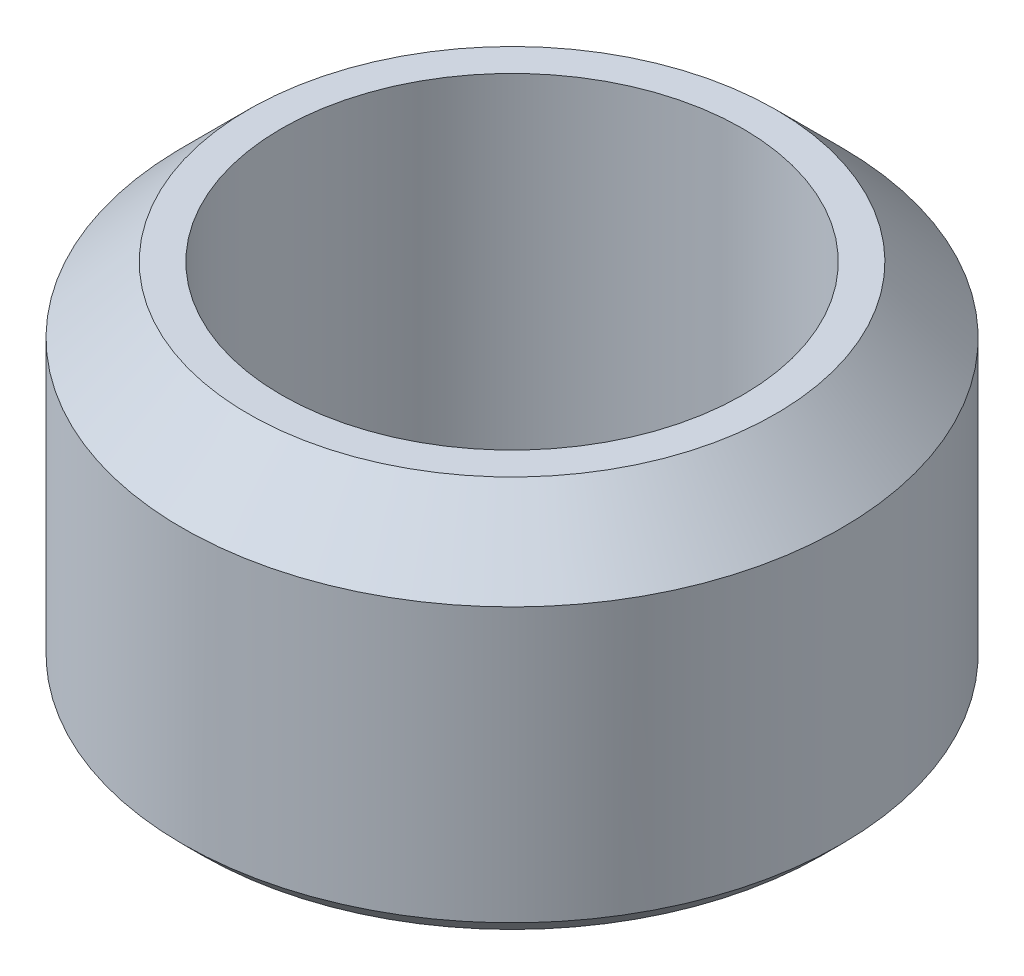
ISO-10303-21;
HEADER;
FILE_DESCRIPTION(('STEP AP214'),'2;1');
FILE_NAME('part.step','',(''),(''),'','','');
FILE_SCHEMA(('AUTOMOTIVE_DESIGN { 1 0 10303 214 1 1 1 1 }'));
ENDSEC;
DATA;
#1=APPLICATION_CONTEXT('core data for automotive mechanical design processes');
#2=APPLICATION_PROTOCOL_DEFINITION('international standard','automotive_design',2000,#1);
#3=PRODUCT_CONTEXT('',#1,'mechanical');
#4=PRODUCT('Part','Part','',(#3));
#5=PRODUCT_RELATED_PRODUCT_CATEGORY('part','',(#4));
#6=PRODUCT_DEFINITION_FORMATION('','',#4);
#7=PRODUCT_DEFINITION_CONTEXT('part definition',#1,'design');
#8=PRODUCT_DEFINITION('design','',#6,#7);
#9=PRODUCT_DEFINITION_SHAPE('','',#8);
#10=(LENGTH_UNIT() NAMED_UNIT(*) SI_UNIT(.MILLI.,.METRE.));
#11=(NAMED_UNIT(*) PLANE_ANGLE_UNIT() SI_UNIT($,.RADIAN.));
#12=(NAMED_UNIT(*) SI_UNIT($,.STERADIAN.) SOLID_ANGLE_UNIT());
#13=UNCERTAINTY_MEASURE_WITH_UNIT(LENGTH_MEASURE(1.E-05),#10,'distance_accuracy_value','');
#14=(GEOMETRIC_REPRESENTATION_CONTEXT(3) GLOBAL_UNCERTAINTY_ASSIGNED_CONTEXT((#13)) GLOBAL_UNIT_ASSIGNED_CONTEXT((#10,
#11,#12)) REPRESENTATION_CONTEXT('',''));
#15=CARTESIAN_POINT('',(0.,0.,0.));
#16=DIRECTION('',(0.,0.,1.));
#17=DIRECTION('',(1.,0.,0.));
#18=AXIS2_PLACEMENT_3D('',#15,#16,#17);
#19=CARTESIAN_POINT('',(-2.22044604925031E-13,54.4999999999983,-4.44089209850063E-13));
#20=DIRECTION('',(0.,-0.999999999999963,0.));
#21=DIRECTION('',(0.,0.,-0.999999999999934));
#22=AXIS2_PLACEMENT_3D('',#19,#20,#21);
#23=CYLINDRICAL_SURFACE('',#22,50.);
#24=CARTESIAN_POINT('',(0.,3.,-3.33066907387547E-13));
#25=DIRECTION('',(0.,0.999999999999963,0.));
#26=DIRECTION('',(0.,0.,0.999999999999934));
#27=AXIS2_PLACEMENT_3D('',#24,#25,#26);
#28=CIRCLE('',#27,50.);
#29=CARTESIAN_POINT('',(9.9711362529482E-13,3.,-49.9999999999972));
#30=VERTEX_POINT('',#29);
#31=EDGE_CURVE('E38',#30,#30,#28,.T.);
#32=CARTESIAN_POINT('',(0.,44.4999999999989,0.));
#33=DIRECTION('',(0.,0.999999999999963,0.));
#34=DIRECTION('',(0.,0.,0.999999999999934));
#35=AXIS2_PLACEMENT_3D('',#32,#33,#34);
#36=CIRCLE('',#35,50.);
#37=CARTESIAN_POINT('',(1.77042740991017E-12,44.4999999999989,-49.9999999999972));
#38=VERTEX_POINT('',#37);
#39=EDGE_CURVE('E42',#38,#38,#36,.F.);
#40=CARTESIAN_POINT('',(9.9711362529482E-13,3.,-49.9999999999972));
#41=CARTESIAN_POINT('',(1.0051689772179E-12,3.43229166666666,-49.9999999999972));
#42=CARTESIAN_POINT('',(1.01322432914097E-12,3.86458333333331,-49.9999999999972));
#43=CARTESIAN_POINT('',(1.02933503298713E-12,4.72916666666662,-49.9999999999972));
#44=CARTESIAN_POINT('',(1.0373903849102E-12,5.16145833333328,-49.9999999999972));
#45=CARTESIAN_POINT('',(1.05350108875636E-12,6.02604166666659,-49.9999999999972));
#46=CARTESIAN_POINT('',(1.06155644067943E-12,6.45833333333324,-49.9999999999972));
#47=CARTESIAN_POINT('',(1.07766714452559E-12,7.32291666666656,-49.9999999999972));
#48=CARTESIAN_POINT('',(1.08572249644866E-12,7.75520833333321,-49.9999999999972));
#49=CARTESIAN_POINT('',(1.10183320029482E-12,8.61979166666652,-49.9999999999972));
#50=CARTESIAN_POINT('',(1.10988855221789E-12,9.05208333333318,-49.9999999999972));
#51=CARTESIAN_POINT('',(1.12599925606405E-12,9.91666666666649,-49.9999999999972));
#52=CARTESIAN_POINT('',(1.13405460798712E-12,10.3489583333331,-49.9999999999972));
#53=CARTESIAN_POINT('',(1.15016531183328E-12,11.2135416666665,-49.9999999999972));
#54=CARTESIAN_POINT('',(1.15822066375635E-12,11.6458333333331,-49.9999999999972));
#55=CARTESIAN_POINT('',(1.1743313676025E-12,12.5104166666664,-49.9999999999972));
#56=CARTESIAN_POINT('',(1.18238671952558E-12,12.9427083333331,-49.9999999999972));
#57=CARTESIAN_POINT('',(1.19849742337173E-12,13.8072916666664,-49.9999999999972));
#58=CARTESIAN_POINT('',(1.20655277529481E-12,14.239583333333,-49.9999999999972));
#59=CARTESIAN_POINT('',(1.22266347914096E-12,15.1041666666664,-49.9999999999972));
#60=CARTESIAN_POINT('',(1.23071883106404E-12,15.536458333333,-49.9999999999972));
#61=CARTESIAN_POINT('',(1.24682953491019E-12,16.4010416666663,-49.9999999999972));
#62=CARTESIAN_POINT('',(1.25488488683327E-12,16.833333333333,-49.9999999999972));
#63=CARTESIAN_POINT('',(1.27099559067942E-12,17.6979166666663,-49.9999999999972));
#64=CARTESIAN_POINT('',(1.2790509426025E-12,18.1302083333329,-49.9999999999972));
#65=CARTESIAN_POINT('',(1.29516164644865E-12,18.9947916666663,-49.9999999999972));
#66=CARTESIAN_POINT('',(1.30321699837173E-12,19.4270833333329,-49.9999999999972));
#67=CARTESIAN_POINT('',(1.31932770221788E-12,20.2916666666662,-49.9999999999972));
#68=CARTESIAN_POINT('',(1.32738305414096E-12,20.7239583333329,-49.9999999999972));
#69=CARTESIAN_POINT('',(1.34349375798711E-12,21.5885416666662,-49.9999999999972));
#70=CARTESIAN_POINT('',(1.35154910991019E-12,22.0208333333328,-49.9999999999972));
#71=CARTESIAN_POINT('',(1.36765981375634E-12,22.8854166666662,-49.9999999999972));
#72=CARTESIAN_POINT('',(1.37571516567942E-12,23.3177083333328,-49.9999999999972));
#73=CARTESIAN_POINT('',(1.39182586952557E-12,24.1822916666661,-49.9999999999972));
#74=CARTESIAN_POINT('',(1.39988122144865E-12,24.6145833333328,-49.9999999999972));
#75=CARTESIAN_POINT('',(1.4159919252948E-12,25.4791666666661,-49.9999999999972));
#76=CARTESIAN_POINT('',(1.42404727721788E-12,25.9114583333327,-49.9999999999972));
#77=CARTESIAN_POINT('',(1.44015798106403E-12,26.7760416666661,-49.9999999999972));
#78=CARTESIAN_POINT('',(1.44821333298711E-12,27.2083333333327,-49.9999999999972));
#79=CARTESIAN_POINT('',(1.46432403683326E-12,28.072916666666,-49.9999999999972));
#80=CARTESIAN_POINT('',(1.47237938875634E-12,28.5052083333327,-49.9999999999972));
#81=CARTESIAN_POINT('',(1.48849009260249E-12,29.369791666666,-49.9999999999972));
#82=CARTESIAN_POINT('',(1.49654544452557E-12,29.8020833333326,-49.9999999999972));
#83=CARTESIAN_POINT('',(1.51265614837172E-12,30.666666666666,-49.9999999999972));
#84=CARTESIAN_POINT('',(1.5207115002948E-12,31.0989583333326,-49.9999999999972));
#85=CARTESIAN_POINT('',(1.53682220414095E-12,31.9635416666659,-49.9999999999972));
#86=CARTESIAN_POINT('',(1.54487755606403E-12,32.3958333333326,-49.9999999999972));
#87=CARTESIAN_POINT('',(1.56098825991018E-12,33.2604166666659,-49.9999999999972));
#88=CARTESIAN_POINT('',(1.56904361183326E-12,33.6927083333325,-49.9999999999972));
#89=CARTESIAN_POINT('',(1.58515431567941E-12,34.5572916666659,-49.9999999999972));
#90=CARTESIAN_POINT('',(1.59320966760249E-12,34.9895833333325,-49.9999999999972));
#91=CARTESIAN_POINT('',(1.60932037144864E-12,35.8541666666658,-49.9999999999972));
#92=CARTESIAN_POINT('',(1.61737572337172E-12,36.2864583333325,-49.9999999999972));
#93=CARTESIAN_POINT('',(1.63348642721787E-12,37.1510416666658,-49.9999999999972));
#94=CARTESIAN_POINT('',(1.64154177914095E-12,37.5833333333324,-49.9999999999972));
#95=CARTESIAN_POINT('',(1.6576524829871E-12,38.4479166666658,-49.9999999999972));
#96=CARTESIAN_POINT('',(1.66570783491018E-12,38.8802083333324,-49.9999999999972));
#97=CARTESIAN_POINT('',(1.68181853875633E-12,39.7447916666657,-49.9999999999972));
#98=CARTESIAN_POINT('',(1.68987389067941E-12,40.1770833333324,-49.9999999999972));
#99=CARTESIAN_POINT('',(1.70598459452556E-12,41.0416666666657,-49.9999999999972));
#100=CARTESIAN_POINT('',(1.71403994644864E-12,41.4739583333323,-49.9999999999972));
#101=CARTESIAN_POINT('',(1.73015065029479E-12,42.3385416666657,-49.9999999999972));
#102=CARTESIAN_POINT('',(1.73820600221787E-12,42.7708333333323,-49.9999999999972));
#103=CARTESIAN_POINT('',(1.75431670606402E-12,43.6354166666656,-49.9999999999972));
#104=CARTESIAN_POINT('',(1.7623720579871E-12,44.0677083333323,-49.9999999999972));
#105=CARTESIAN_POINT('',(1.77042740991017E-12,44.4999999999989,-49.9999999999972));
#106=B_SPLINE_CURVE_WITH_KNOTS('',3,(#40,#41,#42,#43,#44,#45,#46,#47,#48,#49,#50,#51,#52,#53,
#54,#55,#56,#57,#58,#59,#60,#61,#62,#63,#64,#65,#66,#67,#68,#69,#70,#71,#72,#73,#74,#75,#76,#77,
#78,#79,#80,#81,#82,#83,#84,#85,#86,#87,#88,#89,#90,#91,#92,#93,#94,#95,#96,#97,#98,#99,#100,
#101,#102,#103,#104,#105),.UNSPECIFIED.,.F.,.F.,(4,2,2,2,2,2,2,2,2,2,2,2,2,2,2,2,2,2,2,2,2,2,2,
2,2,2,2,2,2,2,2,2,4),(0.,1.29687499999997,2.59374999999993,3.8906249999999,5.18749999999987,
6.48437499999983,7.7812499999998,9.07812499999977,10.3749999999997,11.6718749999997,
12.9687499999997,14.2656249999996,15.5624999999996,16.8593749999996,18.1562499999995,
19.4531249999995,20.7499999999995,22.0468749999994,23.3437499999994,24.6406249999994,
25.9374999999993,27.2343749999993,28.5312499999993,29.8281249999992,31.1249999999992,
32.4218749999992,33.7187499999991,35.0156249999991,36.3124999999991,37.609374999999,
38.906249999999,40.203124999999,41.4999999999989),.UNSPECIFIED.);
#107=EDGE_CURVE('BSEAM32',#30,#38,#106,.T.);
#108=ORIENTED_EDGE('',*,*,#31,.T.);
#109=ORIENTED_EDGE('',*,*,#39,.T.);
#110=ORIENTED_EDGE('',*,*,#107,.T.);
#111=ORIENTED_EDGE('',*,*,#107,.F.);
#112=EDGE_LOOP('',(#108,#110,#109,#111));
#113=FACE_BOUND('',#112,.T.);
#114=ADVANCED_FACE('F32',(#113),#23,.T.);
#115=CARTESIAN_POINT('',(-2.22044604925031E-13,54.4999999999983,-4.44089209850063E-13));
#116=DIRECTION('',(0.,0.999999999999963,0.));
#117=DIRECTION('',(0.,0.,0.999999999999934));
#118=AXIS2_PLACEMENT_3D('',#115,#116,#117);
#119=PLANE('',#118);
#120=CARTESIAN_POINT('',(-2.22044604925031E-13,54.4999999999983,-4.44089209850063E-13));
#121=DIRECTION('',(0.,0.999999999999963,0.));
#122=DIRECTION('',(0.,0.,0.999999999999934));
#123=AXIS2_PLACEMENT_3D('',#120,#121,#122);
#124=CIRCLE('',#123,35.);
#125=CARTESIAN_POINT('',(-1.12021625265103E-12,54.4999999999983,34.9999999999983));
#126=VERTEX_POINT('',#125);
#127=EDGE_CURVE('E54',#126,#126,#124,.T.);
#128=ORIENTED_EDGE('',*,*,#127,.F.);
#129=EDGE_LOOP('',(#128));
#130=FACE_BOUND('',#129,.T.);
#131=CARTESIAN_POINT('',(-2.22044604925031E-13,54.4999999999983,-4.44089209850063E-13));
#132=DIRECTION('',(0.,0.999999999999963,0.));
#133=DIRECTION('',(0.,0.,0.999999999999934));
#134=AXIS2_PLACEMENT_3D('',#131,#132,#133);
#135=CIRCLE('',#134,40.);
#136=CARTESIAN_POINT('',(1.52100554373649E-12,54.4999999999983,-39.9999999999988));
#137=VERTEX_POINT('',#136);
#138=EDGE_CURVE('E46',#137,#137,#135,.T.);
#139=ORIENTED_EDGE('',*,*,#138,.T.);
#140=EDGE_LOOP('',(#139));
#141=FACE_BOUND('',#140,.T.);
#142=ADVANCED_FACE('F61',(#130,#141),#119,.T.);
#143=CARTESIAN_POINT('',(0.,0.,0.));
#144=DIRECTION('',(0.,0.999999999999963,0.));
#145=DIRECTION('',(0.,0.,0.999999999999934));
#146=AXIS2_PLACEMENT_3D('',#143,#144,#145);
#147=PLANE('',#146);
#148=CARTESIAN_POINT('',(0.,0.,0.));
#149=DIRECTION('',(0.,0.999999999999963,0.));
#150=DIRECTION('',(0.,0.,0.999999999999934));
#151=AXIS2_PLACEMENT_3D('',#148,#149,#150);
#152=CIRCLE('',#151,35.);
#153=CARTESIAN_POINT('',(-2.13577290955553E-12,0.,34.9999999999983));
#154=VERTEX_POINT('',#153);
#155=EDGE_CURVE('E51',#154,#154,#152,.F.);
#156=ORIENTED_EDGE('',*,*,#155,.F.);
#157=EDGE_LOOP('',(#156));
#158=FACE_BOUND('',#157,.T.);
#159=CARTESIAN_POINT('',(0.,0.,0.));
#160=DIRECTION('',(0.,0.999999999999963,0.));
#161=DIRECTION('',(0.,0.,0.999999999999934));
#162=AXIS2_PLACEMENT_3D('',#159,#160,#161);
#163=CIRCLE('',#162,47.);
#164=CARTESIAN_POINT('',(-2.04808392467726E-12,-1.12495407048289E-12,46.9999999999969));
#165=VERTEX_POINT('',#164);
#166=EDGE_CURVE('E10',#165,#165,#163,.F.);
#167=ORIENTED_EDGE('',*,*,#166,.T.);
#168=EDGE_LOOP('',(#167));
#169=FACE_BOUND('',#168,.T.);
#170=ADVANCED_FACE('F64',(#158,#169),#147,.F.);
#171=CARTESIAN_POINT('',(-2.22044604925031E-13,54.4999999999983,-4.44089209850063E-13));
#172=DIRECTION('',(0.,-0.999999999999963,0.));
#173=DIRECTION('',(0.,0.,-0.999999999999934));
#174=AXIS2_PLACEMENT_3D('',#171,#172,#173);
#175=CONICAL_SURFACE('',#174,40.,0.785398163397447);
#176=CARTESIAN_POINT('',(1.77042740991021E-12,44.4999999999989,-49.9999999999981));
#177=CARTESIAN_POINT('',(1.7678292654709E-12,44.6041666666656,-49.8958333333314));
#178=CARTESIAN_POINT('',(1.76523112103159E-12,44.7083333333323,-49.7916666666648));
#179=CARTESIAN_POINT('',(1.76003483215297E-12,44.9166666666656,-49.5833333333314));
#180=CARTESIAN_POINT('',(1.75743668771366E-12,45.0208333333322,-49.4791666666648));
#181=CARTESIAN_POINT('',(1.75224039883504E-12,45.2291666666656,-49.2708333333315));
#182=CARTESIAN_POINT('',(1.74964225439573E-12,45.3333333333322,-49.1666666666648));
#183=CARTESIAN_POINT('',(1.74444596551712E-12,45.5416666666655,-48.9583333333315));
#184=CARTESIAN_POINT('',(1.74184782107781E-12,45.6458333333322,-48.8541666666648));
#185=CARTESIAN_POINT('',(1.73665153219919E-12,45.8541666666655,-48.6458333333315));
#186=CARTESIAN_POINT('',(1.73405338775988E-12,45.9583333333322,-48.5416666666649));
#187=CARTESIAN_POINT('',(1.72885709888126E-12,46.1666666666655,-48.3333333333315));
#188=CARTESIAN_POINT('',(1.72625895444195E-12,46.2708333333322,-48.2291666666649));
#189=CARTESIAN_POINT('',(1.72106266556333E-12,46.4791666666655,-48.0208333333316));
#190=CARTESIAN_POINT('',(1.71846452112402E-12,46.5833333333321,-47.9166666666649));
#191=CARTESIAN_POINT('',(1.7132682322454E-12,46.7916666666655,-47.7083333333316));
#192=CARTESIAN_POINT('',(1.71067008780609E-12,46.8958333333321,-47.6041666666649));
#193=CARTESIAN_POINT('',(1.70547379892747E-12,47.1041666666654,-47.3958333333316));
#194=CARTESIAN_POINT('',(1.70287565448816E-12,47.2083333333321,-47.2916666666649));
#195=CARTESIAN_POINT('',(1.69767936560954E-12,47.4166666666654,-47.0833333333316));
#196=CARTESIAN_POINT('',(1.69508122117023E-12,47.5208333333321,-46.979166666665));
#197=CARTESIAN_POINT('',(1.68988493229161E-12,47.7291666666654,-46.7708333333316));
#198=CARTESIAN_POINT('',(1.6872867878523E-12,47.8333333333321,-46.666666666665));
#199=CARTESIAN_POINT('',(1.68209049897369E-12,48.0416666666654,-46.4583333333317));
#200=CARTESIAN_POINT('',(1.67949235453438E-12,48.145833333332,-46.354166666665));
#201=CARTESIAN_POINT('',(1.67429606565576E-12,48.3541666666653,-46.1458333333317));
#202=CARTESIAN_POINT('',(1.67169792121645E-12,48.458333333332,-46.041666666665));
#203=CARTESIAN_POINT('',(1.66650163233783E-12,48.6666666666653,-45.8333333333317));
#204=CARTESIAN_POINT('',(1.66390348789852E-12,48.770833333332,-45.7291666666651));
#205=CARTESIAN_POINT('',(1.6587071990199E-12,48.9791666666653,-45.5208333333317));
#206=CARTESIAN_POINT('',(1.65610905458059E-12,49.083333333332,-45.4166666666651));
#207=CARTESIAN_POINT('',(1.65091276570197E-12,49.2916666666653,-45.2083333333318));
#208=CARTESIAN_POINT('',(1.64831462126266E-12,49.3958333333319,-45.1041666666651));
#209=CARTESIAN_POINT('',(1.64311833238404E-12,49.6041666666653,-44.8958333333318));
#210=CARTESIAN_POINT('',(1.64052018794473E-12,49.7083333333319,-44.7916666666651));
#211=CARTESIAN_POINT('',(1.63532389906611E-12,49.9166666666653,-44.5833333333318));
#212=CARTESIAN_POINT('',(1.6327257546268E-12,50.0208333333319,-44.4791666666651));
#213=CARTESIAN_POINT('',(1.62752946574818E-12,50.2291666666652,-44.2708333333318));
#214=CARTESIAN_POINT('',(1.62493132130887E-12,50.3333333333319,-44.1666666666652));
#215=CARTESIAN_POINT('',(1.61973503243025E-12,50.5416666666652,-43.9583333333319));
#216=CARTESIAN_POINT('',(1.61713688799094E-12,50.6458333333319,-43.8541666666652));
#217=CARTESIAN_POINT('',(1.61194059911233E-12,50.8541666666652,-43.6458333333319));
#218=CARTESIAN_POINT('',(1.60934245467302E-12,50.9583333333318,-43.5416666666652));
#219=CARTESIAN_POINT('',(1.6041461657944E-12,51.1666666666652,-43.3333333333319));
#220=CARTESIAN_POINT('',(1.60154802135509E-12,51.2708333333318,-43.2291666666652));
#221=CARTESIAN_POINT('',(1.59635173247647E-12,51.4791666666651,-43.0208333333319));
#222=CARTESIAN_POINT('',(1.59375358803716E-12,51.5833333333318,-42.9166666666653));
#223=CARTESIAN_POINT('',(1.58855729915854E-12,51.7916666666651,-42.7083333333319));
#224=CARTESIAN_POINT('',(1.58595915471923E-12,51.8958333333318,-42.6041666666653));
#225=CARTESIAN_POINT('',(1.58076286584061E-12,52.1041666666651,-42.395833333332));
#226=CARTESIAN_POINT('',(1.5781647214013E-12,52.2083333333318,-42.2916666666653));
#227=CARTESIAN_POINT('',(1.57296843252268E-12,52.4166666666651,-42.083333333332));
#228=CARTESIAN_POINT('',(1.57037028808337E-12,52.5208333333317,-41.9791666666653));
#229=CARTESIAN_POINT('',(1.56517399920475E-12,52.7291666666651,-41.770833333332));
#230=CARTESIAN_POINT('',(1.56257585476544E-12,52.8333333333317,-41.6666666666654));
#231=CARTESIAN_POINT('',(1.55737956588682E-12,53.041666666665,-41.458333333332));
#232=CARTESIAN_POINT('',(1.55478142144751E-12,53.1458333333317,-41.3541666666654));
#233=CARTESIAN_POINT('',(1.5495851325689E-12,53.354166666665,-41.1458333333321));
#234=CARTESIAN_POINT('',(1.54698698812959E-12,53.4583333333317,-41.0416666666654));
#235=CARTESIAN_POINT('',(1.54179069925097E-12,53.666666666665,-40.8333333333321));
#236=CARTESIAN_POINT('',(1.53919255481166E-12,53.7708333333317,-40.7291666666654));
#237=CARTESIAN_POINT('',(1.53399626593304E-12,53.979166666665,-40.5208333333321));
#238=CARTESIAN_POINT('',(1.53139812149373E-12,54.0833333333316,-40.4166666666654));
#239=CARTESIAN_POINT('',(1.52620183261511E-12,54.291666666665,-40.2083333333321));
#240=CARTESIAN_POINT('',(1.5236036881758E-12,54.3958333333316,-40.1041666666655));
#241=CARTESIAN_POINT('',(1.52100554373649E-12,54.4999999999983,-39.9999999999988));
#242=B_SPLINE_CURVE_WITH_KNOTS('',3,(#176,#177,#178,#179,#180,#181,#182,#183,#184,#185,#186,
#187,#188,#189,#190,#191,#192,#193,#194,#195,#196,#197,#198,#199,#200,#201,#202,#203,#204,#205,
#206,#207,#208,#209,#210,#211,#212,#213,#214,#215,#216,#217,#218,#219,#220,#221,#222,#223,#224,
#225,#226,#227,#228,#229,#230,#231,#232,#233,#234,#235,#236,#237,#238,#239,#240,#241),
.UNSPECIFIED.,.F.,.F.,(4,2,2,2,2,2,2,2,2,2,2,2,2,2,2,2,2,2,2,2,2,2,2,2,2,2,2,2,2,2,2,2,4),(0.,
0.441941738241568,0.883883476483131,1.32582521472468,1.76776695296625,2.20970869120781,
2.65165042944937,3.09359216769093,3.5355339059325,3.97747564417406,4.41941738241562,
4.86135912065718,5.30330085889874,5.7452425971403,6.18718433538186,6.62912607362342,
7.07106781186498,7.51300955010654,7.9549512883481,8.39689302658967,8.83883476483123,
9.28077650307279,9.72271824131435,10.1646599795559,10.6066017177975,11.048543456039,
11.4904851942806,11.9324269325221,12.3743686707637,12.8163104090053,13.2582521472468,
13.7001938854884,14.14213562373),.UNSPECIFIED.);
#243=EDGE_CURVE('BSEAM67',#38,#137,#242,.T.);
#244=ORIENTED_EDGE('',*,*,#39,.F.);
#245=ORIENTED_EDGE('',*,*,#138,.F.);
#246=ORIENTED_EDGE('',*,*,#243,.T.);
#247=ORIENTED_EDGE('',*,*,#243,.F.);
#248=EDGE_LOOP('',(#244,#246,#245,#247));
#249=FACE_BOUND('',#248,.T.);
#250=ADVANCED_FACE('F67',(#249),#175,.T.);
#251=CARTESIAN_POINT('',(0.,3.,-3.33066907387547E-13));
#252=DIRECTION('',(0.,0.999999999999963,0.));
#253=DIRECTION('',(0.,0.,0.999999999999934));
#254=AXIS2_PLACEMENT_3D('',#251,#252,#253);
#255=CONICAL_SURFACE('',#254,50.,0.785398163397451);
#256=ORIENTED_EDGE('',*,*,#166,.F.);
#257=EDGE_LOOP('',(#256));
#258=FACE_BOUND('',#257,.T.);
#259=ORIENTED_EDGE('',*,*,#31,.F.);
#260=EDGE_LOOP('',(#259));
#261=FACE_BOUND('',#260,.T.);
#262=ADVANCED_FACE('F69',(#258,#261),#255,.T.);
#263=CARTESIAN_POINT('',(-6.10622663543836E-13,-0.00100000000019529,5.55111512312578E-13));
#264=DIRECTION('',(0.,0.999999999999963,0.));
#265=DIRECTION('',(0.,0.,0.999999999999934));
#266=AXIS2_PLACEMENT_3D('',#263,#264,#265);
#267=CYLINDRICAL_SURFACE('',#266,35.);
#268=CARTESIAN_POINT('',(-1.12021625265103E-12,54.4999999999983,34.9999999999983));
#269=CARTESIAN_POINT('',(-1.13079496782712E-12,53.932291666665,34.9999999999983));
#270=CARTESIAN_POINT('',(-1.14137368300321E-12,53.3645833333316,34.9999999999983));
#271=CARTESIAN_POINT('',(-1.16253111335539E-12,52.229166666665,34.9999999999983));
#272=CARTESIAN_POINT('',(-1.17310982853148E-12,51.6614583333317,34.9999999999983));
#273=CARTESIAN_POINT('',(-1.19426725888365E-12,50.5260416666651,34.9999999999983));
#274=CARTESIAN_POINT('',(-1.20484597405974E-12,49.9583333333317,34.9999999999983));
#275=CARTESIAN_POINT('',(-1.22600340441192E-12,48.8229166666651,34.9999999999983));
#276=CARTESIAN_POINT('',(-1.23658211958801E-12,48.2552083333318,34.9999999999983));
#277=CARTESIAN_POINT('',(-1.25773954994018E-12,47.1197916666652,34.9999999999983));
#278=CARTESIAN_POINT('',(-1.26831826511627E-12,46.5520833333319,34.9999999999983));
#279=CARTESIAN_POINT('',(-1.28947569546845E-12,45.4166666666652,34.9999999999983));
#280=CARTESIAN_POINT('',(-1.30005441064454E-12,44.8489583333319,34.9999999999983));
#281=CARTESIAN_POINT('',(-1.32121184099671E-12,43.7135416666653,34.9999999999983));
#282=CARTESIAN_POINT('',(-1.3317905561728E-12,43.145833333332,34.9999999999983));
#283=CARTESIAN_POINT('',(-1.35294798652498E-12,42.0104166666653,34.9999999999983));
#284=CARTESIAN_POINT('',(-1.36352670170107E-12,41.442708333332,34.9999999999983));
#285=CARTESIAN_POINT('',(-1.38468413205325E-12,40.3072916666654,34.9999999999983));
#286=CARTESIAN_POINT('',(-1.39526284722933E-12,39.7395833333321,34.9999999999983));
#287=CARTESIAN_POINT('',(-1.41642027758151E-12,38.6041666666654,34.9999999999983));
#288=CARTESIAN_POINT('',(-1.4269989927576E-12,38.0364583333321,34.9999999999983));
#289=CARTESIAN_POINT('',(-1.44815642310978E-12,36.9010416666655,34.9999999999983));
#290=CARTESIAN_POINT('',(-1.45873513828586E-12,36.3333333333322,34.9999999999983));
#291=CARTESIAN_POINT('',(-1.47989256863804E-12,35.1979166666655,34.9999999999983));
#292=CARTESIAN_POINT('',(-1.49047128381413E-12,34.6302083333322,34.9999999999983));
#293=CARTESIAN_POINT('',(-1.51162871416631E-12,33.4947916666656,34.9999999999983));
#294=CARTESIAN_POINT('',(-1.5222074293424E-12,32.9270833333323,34.9999999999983));
#295=CARTESIAN_POINT('',(-1.54336485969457E-12,31.7916666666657,34.9999999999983));
#296=CARTESIAN_POINT('',(-1.55394357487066E-12,31.2239583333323,34.9999999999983));
#297=CARTESIAN_POINT('',(-1.57510100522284E-12,30.0885416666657,34.9999999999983));
#298=CARTESIAN_POINT('',(-1.58567972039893E-12,29.5208333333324,34.9999999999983));
#299=CARTESIAN_POINT('',(-1.6068371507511E-12,28.3854166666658,34.9999999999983));
#300=CARTESIAN_POINT('',(-1.61741586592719E-12,27.8177083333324,34.9999999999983));
#301=CARTESIAN_POINT('',(-1.63857329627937E-12,26.6822916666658,34.9999999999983));
#302=CARTESIAN_POINT('',(-1.64915201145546E-12,26.1145833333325,34.9999999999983));
#303=CARTESIAN_POINT('',(-1.67030944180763E-12,24.9791666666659,34.9999999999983));
#304=CARTESIAN_POINT('',(-1.68088815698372E-12,24.4114583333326,34.9999999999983));
#305=CARTESIAN_POINT('',(-1.7020455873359E-12,23.2760416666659,34.9999999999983));
#306=CARTESIAN_POINT('',(-1.71262430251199E-12,22.7083333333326,34.9999999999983));
#307=CARTESIAN_POINT('',(-1.73378173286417E-12,21.572916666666,34.9999999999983));
#308=CARTESIAN_POINT('',(-1.74436044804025E-12,21.0052083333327,34.9999999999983));
#309=CARTESIAN_POINT('',(-1.76551787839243E-12,19.869791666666,34.9999999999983));
#310=CARTESIAN_POINT('',(-1.77609659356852E-12,19.3020833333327,34.9999999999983));
#311=CARTESIAN_POINT('',(-1.7972540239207E-12,18.1666666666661,34.9999999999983));
#312=CARTESIAN_POINT('',(-1.80783273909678E-12,17.5989583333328,34.9999999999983));
#313=CARTESIAN_POINT('',(-1.82899016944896E-12,16.4635416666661,34.9999999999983));
#314=CARTESIAN_POINT('',(-1.83956888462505E-12,15.8958333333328,34.9999999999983));
#315=CARTESIAN_POINT('',(-1.86072631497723E-12,14.7604166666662,34.9999999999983));
#316=CARTESIAN_POINT('',(-1.87130503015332E-12,14.1927083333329,34.9999999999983));
#317=CARTESIAN_POINT('',(-1.89246246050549E-12,13.0572916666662,34.9999999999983));
#318=CARTESIAN_POINT('',(-1.90304117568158E-12,12.4895833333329,34.9999999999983));
#319=CARTESIAN_POINT('',(-1.92419860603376E-12,11.3541666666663,34.9999999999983));
#320=CARTESIAN_POINT('',(-1.93477732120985E-12,10.786458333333,34.9999999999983));
#321=CARTESIAN_POINT('',(-1.95593475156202E-12,9.65104166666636,34.9999999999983));
#322=CARTESIAN_POINT('',(-1.96651346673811E-12,9.08333333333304,34.9999999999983));
#323=CARTESIAN_POINT('',(-1.98767089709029E-12,7.94791666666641,34.9999999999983));
#324=CARTESIAN_POINT('',(-1.99824961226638E-12,7.38020833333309,34.9999999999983));
#325=CARTESIAN_POINT('',(-2.01940704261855E-12,6.24479166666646,34.9999999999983));
#326=CARTESIAN_POINT('',(-2.02998575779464E-12,5.67708333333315,34.9999999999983));
#327=CARTESIAN_POINT('',(-2.05114318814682E-12,4.54166666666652,34.9999999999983));
#328=CARTESIAN_POINT('',(-2.06172190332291E-12,3.9739583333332,34.9999999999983));
#329=CARTESIAN_POINT('',(-2.08287933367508E-12,2.83854166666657,34.9999999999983));
#330=CARTESIAN_POINT('',(-2.09345804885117E-12,2.27083333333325,34.9999999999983));
#331=CARTESIAN_POINT('',(-2.11461547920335E-12,1.13541666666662,34.9999999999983));
#332=CARTESIAN_POINT('',(-2.12519419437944E-12,0.567708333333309,34.9999999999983));
#333=CARTESIAN_POINT('',(-2.13577290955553E-12,0.,34.9999999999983));
#334=B_SPLINE_CURVE_WITH_KNOTS('',3,(#268,#269,#270,#271,#272,#273,#274,#275,#276,#277,#278,
#279,#280,#281,#282,#283,#284,#285,#286,#287,#288,#289,#290,#291,#292,#293,#294,#295,#296,#297,
#298,#299,#300,#301,#302,#303,#304,#305,#306,#307,#308,#309,#310,#311,#312,#313,#314,#315,#316,
#317,#318,#319,#320,#321,#322,#323,#324,#325,#326,#327,#328,#329,#330,#331,#332,#333),
.UNSPECIFIED.,.F.,.F.,(4,2,2,2,2,2,2,2,2,2,2,2,2,2,2,2,2,2,2,2,2,2,2,2,2,2,2,2,2,2,2,2,4),(0.,
1.70312499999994,3.40624999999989,5.10937499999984,6.81249999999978,8.51562499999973,
10.2187499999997,11.9218749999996,13.6249999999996,15.3281249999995,17.0312499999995,
18.7343749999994,20.4374999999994,22.1406249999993,23.8437499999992,25.5468749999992,
27.2499999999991,28.9531249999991,30.656249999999,32.359374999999,34.0624999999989,
35.7656249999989,37.4687499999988,39.1718749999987,40.8749999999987,42.5781249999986,
44.2812499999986,45.9843749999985,47.6874999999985,49.3906249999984,51.0937499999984,
52.7968749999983,54.4999999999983),.UNSPECIFIED.);
#335=EDGE_CURVE('BSEAM58',#126,#154,#334,.T.);
#336=ORIENTED_EDGE('',*,*,#127,.T.);
#337=ORIENTED_EDGE('',*,*,#155,.T.);
#338=ORIENTED_EDGE('',*,*,#335,.T.);
#339=ORIENTED_EDGE('',*,*,#335,.F.);
#340=EDGE_LOOP('',(#336,#338,#337,#339));
#341=FACE_BOUND('',#340,.T.);
#342=ADVANCED_FACE('F58',(#341),#267,.F.);
#343=CLOSED_SHELL('',(#114,#142,#170,#250,#262,#342));
#344=MANIFOLD_SOLID_BREP('B2',#343);
#345=ADVANCED_BREP_SHAPE_REPRESENTATION('',(#18,#344),#14);
#346=SHAPE_DEFINITION_REPRESENTATION(#9,#345);
ENDSEC;
END-ISO-10303-21;
